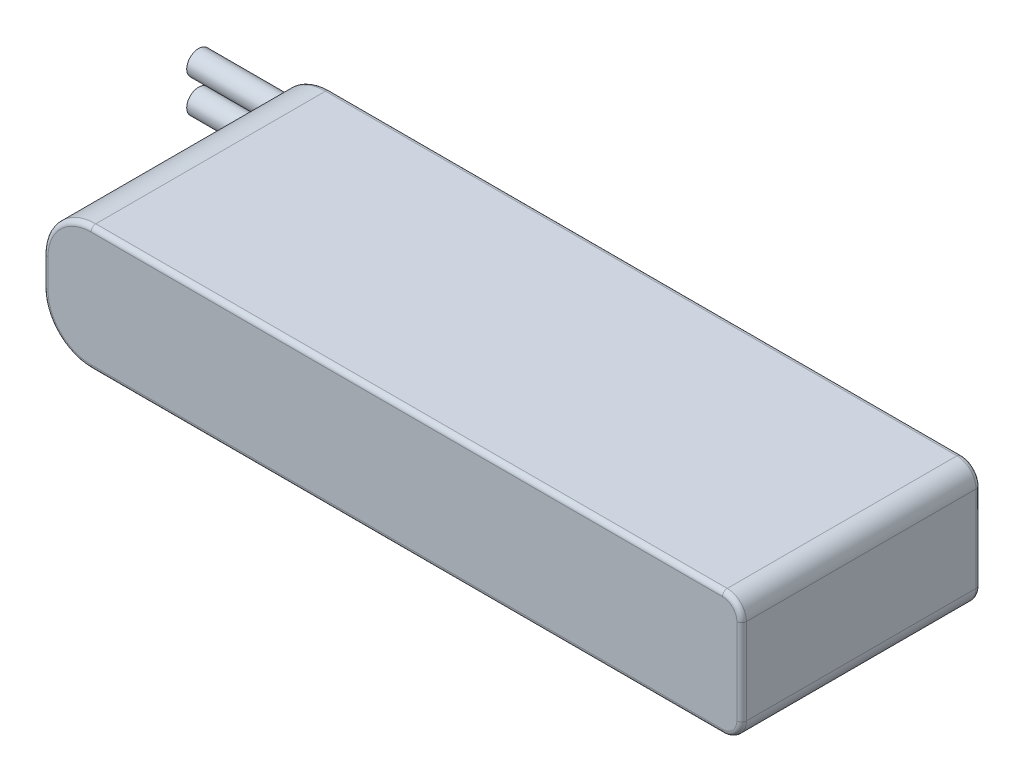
from build123d import *

# Parameters (mm, degrees)
SKETCH1_W                = 146
SKETCH1_H                = 50
BOSS_EXTRUDE1_DEPTH      = 26
FILLET1_R                = 4
FILLET2_R                = 10
FILLET3_R                = 1
BOSS_EXTRUDE2_DEPTH      = 18
BOSS_EXTRUDE2_DEPTH_BACK = 10
SKETCH2_R                = 2.5


with BuildPart() as part:
    # Sketch1 → Boss-Extrude1 (new body)
    with BuildSketch(Plane(origin=(0, 0, 0), x_dir=(1, 0, 0), z_dir=(0, 1, 0))):
        Rectangle(SKETCH1_W, SKETCH1_H)
    extrude(amount=BOSS_EXTRUDE1_DEPTH)

    # Fillet1
    fillet1_edges = [part.edges().sort_by_distance(p)[0] for p in [
        (73, 26, 0),
        (73, 0, 0),
    ]]
    fillet(fillet1_edges, radius=FILLET1_R)

    # Fillet2
    fillet2_edges = [part.edges().sort_by_distance(p)[0] for p in [
        (-73, 26, 0),
        (-73, 0, 0),
    ]]
    fillet(fillet2_edges, radius=FILLET2_R)

    # Fillet3
    fillet3_edges = [part.edges().sort_by_distance(p)[0] for p in [
        (73, 13, -25),
        (73, 13, 25),
        (3, 0, -25),
        (3, 26, -25),
        (71.828427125, 24.828427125, -25),
        (71.828427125, 1.171572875, -25),
        (71.828427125, 24.828427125, 25),
        (71.828427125, 1.171572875, 25),
        (-73, 13, 25),
        (-73, 13, -25),
        (3, 0, 25),
        (3, 26, 25),
        (-70.071067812, 23.071067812, 25),
        (-70.071067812, 2.928932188, 25),
        (-70.071067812, 23.071067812, -25),
        (-70.071067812, 2.928932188, -25),
    ]]
    fillet(fillet3_edges, radius=FILLET3_R)

    # Sketch2 → Boss-Extrude2 (add, two sides: drawn at the far end of the back side and taken through both)
    with BuildSketch(Plane.ZY.offset(73).offset(-BOSS_EXTRUDE2_DEPTH_BACK)):
        with Locations((-25.5, 16.5)):
            Circle(SKETCH2_R)
        with Locations((-25.5, 9.5)):
            Circle(SKETCH2_R)
    extrude(amount=BOSS_EXTRUDE2_DEPTH + BOSS_EXTRUDE2_DEPTH_BACK)


solid = part.part
